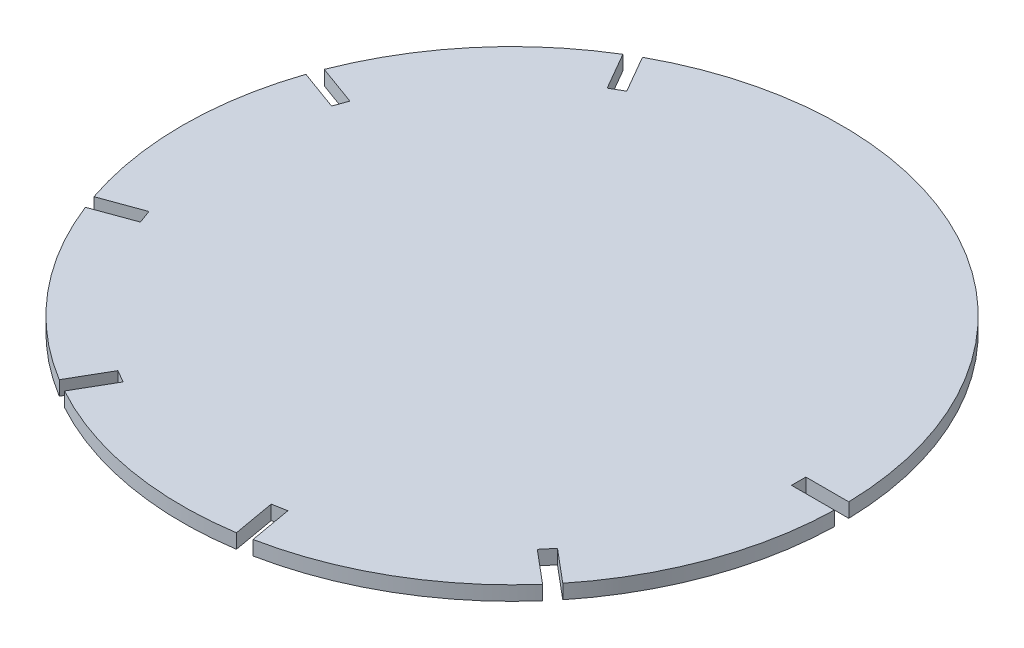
from build123d import *

# Parameters (mm, degrees)
SKETCH1_R           = 345
BOSS_EXTRUDE1_DEPTH = 15
CUT_EXTRUDE3_START  = -15
CUT_EXTRUDE3_DEPTH  = 15


with BuildPart() as part:
    # Sketch1 → Boss-Extrude1 (new body)
    with BuildSketch(Plane(origin=(0, 0, 0), x_dir=(1, 0, 0), z_dir=(0, 1, 0))):
        with Locations(Location((0, 0, 0), (0, 0, 270))):
            Circle(SKETCH1_R)
    extrude(amount=BOSS_EXTRUDE1_DEPTH)

    # Sketch2 → Cut-Extrude3 (cut)
    with BuildSketch(Plane(origin=(0, 15, 0), x_dir=(1, 0, 0), z_dir=(0, 1, 0)).offset(CUT_EXTRUDE3_START)):
        with BuildLine():
            Line((344.918468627, 7.5), (300, 7.5))
            Line((300, 7.5), (300, -7.5))
            Line((300, -7.5), (344.918468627, -7.5))
            ThreePointArc((344.918468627, -7.5), (345, 0), (344.918468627, 7.5))
        make_face()
        with BuildLine():
            Line((-143.504809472, 263.557621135), (-165.964043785, 302.458156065))
            ThreePointArc((-165.964043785, 302.458156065), (-172.5, 298.778764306), (-178.954424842, 294.958156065))
            Line((-178.954424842, 294.958156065), (-156.495190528, 256.057621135))
            Line((-156.495190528, 256.057621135), (-143.504809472, 263.557621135))
        make_face()
        with BuildLine():
            ThreePointArc((259.401969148, -227.454651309), (264.285332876, -221.761725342), (269.043783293, -215.963984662))
            Line((269.043783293, -215.963984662), (234.634240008, -187.090949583))
            Line((234.634240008, -187.090949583), (224.992425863, -198.581616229))
            Line((224.992425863, -198.581616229), (259.401969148, -227.454651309))
        make_face()
        with BuildLine():
            Line((-279.342635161, 109.653737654), (-321.552188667, 125.016758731))
            ThreePointArc((-321.552188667, 125.016758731), (-324.193954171, 117.996949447), (-326.682490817, 110.92136942))
            Line((-326.682490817, 110.92136942), (-284.472937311, 95.558348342))
            Line((-284.472937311, 95.558348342), (-279.342635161, 109.653737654))
        make_face()
        with BuildLine():
            ThreePointArc((52.508405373, -340.980743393), (59.908621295, -339.758674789), (67.280521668, -338.376020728))
            Line((67.280521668, -338.376020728), (59.480511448, -294.139964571))
            Line((59.480511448, -294.139964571), (44.708395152, -296.744687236))
            Line((44.708395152, -296.744687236), (52.508405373, -340.980743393))
        make_face()
        with BuildLine():
            Line((-284.472937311, -95.558348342), (-326.682490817, -110.92136942))
            ThreePointArc((-326.682490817, -110.92136942), (-324.193954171, -117.996949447), (-321.552188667, -125.016758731))
            Line((-321.552188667, -125.016758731), (-279.342635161, -109.653737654))
            Line((-279.342635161, -109.653737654), (-284.472937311, -95.558348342))
        make_face()
        with BuildLine():
            ThreePointArc((-178.954424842, -294.958156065), (-172.5, -298.778764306), (-165.964043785, -302.458156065))
            Line((-165.964043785, -302.458156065), (-143.504809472, -263.557621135))
            Line((-143.504809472, -263.557621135), (-156.495190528, -256.057621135))
            Line((-156.495190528, -256.057621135), (-178.954424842, -294.958156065))
        make_face()
    extrude(amount=CUT_EXTRUDE3_DEPTH, mode=Mode.SUBTRACT)


solid = part.part
